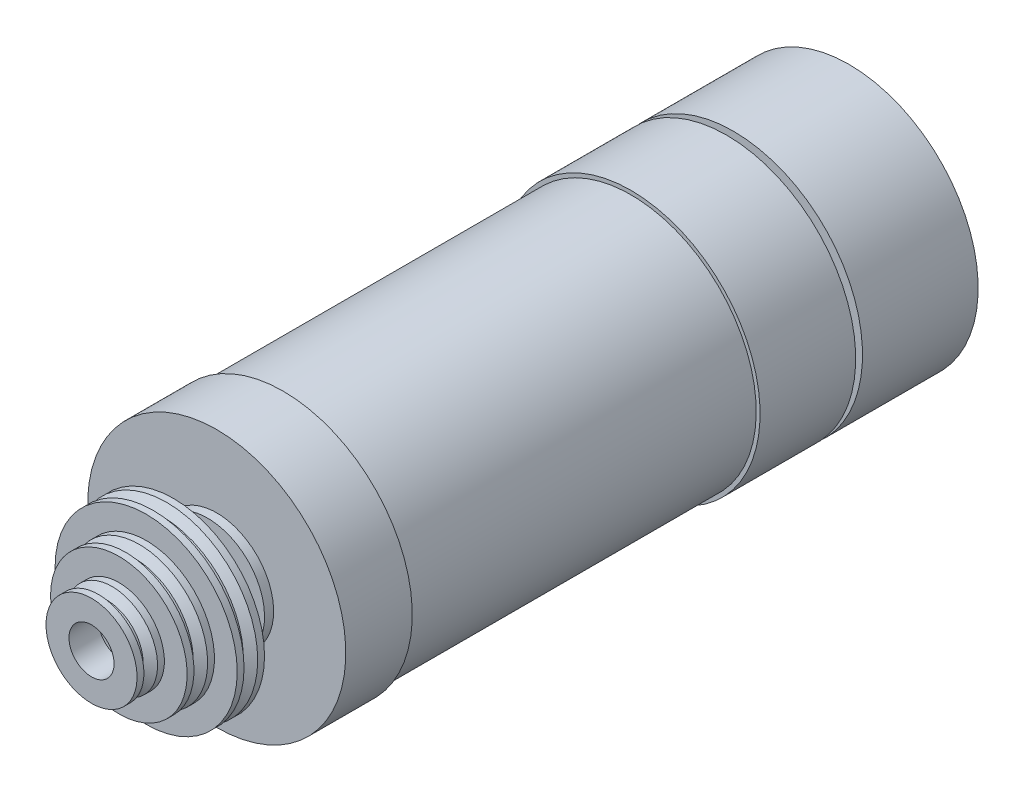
from build123d import *


with BuildPart() as part:
    # Sketch2 → Revolve1 (revolve)
    with BuildSketch(Plane(origin=(0, 0, 0), x_dir=(0, 0, -1), z_dir=(1, 0, 0)), mode=Mode.PRIVATE) as revolve1_sk:
        Polygon((-77, 0), (-77, 4.95), (-58, 4.95), (-58, 12.5), (-56, 12.5), (-56, 28.35), (-41.4, 28.35), (-41.4, 27.5), (35, 27.5), (35, 28.35), (56, 28.35), (56, 10), (57.5, 10), (57.5, 28.35), (82.9, 28.35), (82.9, 4.95), (85.7, 4.95), (85.7, 0), align=None)
    revolve(revolve1_sk.sketch.rotate(Axis((0, 0, 96.950371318), (0, 0, -1)), 180), axis=Axis((0, 0, 96.950371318), (0, 0, -1)))


with BuildPart() as body_2:
    # Sketch3 → Revolve2 (revolve)
    with BuildSketch(Plane(origin=(0, 0, 0), x_dir=(0, 0, -1), z_dir=(1, 0, 0)), mode=Mode.PRIVATE) as revolve2_sk:
        Polygon((-83.5, 4.95), (-58.5, 4.95), (-58.5, 9), (-65.5, 9), (-65.5, 20), (-67, 20), (-68.154700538, 18), (-68.845299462, 18), (-70, 20), (-71.5, 20), (-71.5, 15), (-73, 15), (-74.154700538, 13), (-74.845299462, 13), (-76, 15), (-77.5, 15), (-77.5, 10), (-79, 10), (-80.154700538, 8), (-80.845299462, 8), (-82, 10), (-83.5, 10), align=None)
    revolve(revolve2_sk.sketch.rotate(Axis((0, 0, 0), (0, 0, 1)), 90), axis=Axis((0, 0, 0), (0, 0, 1)))


with BuildPart() as part_1:
    add(part.part)

    # Combine1: union body 2
    add(body_2.part)


solid = part_1.part
